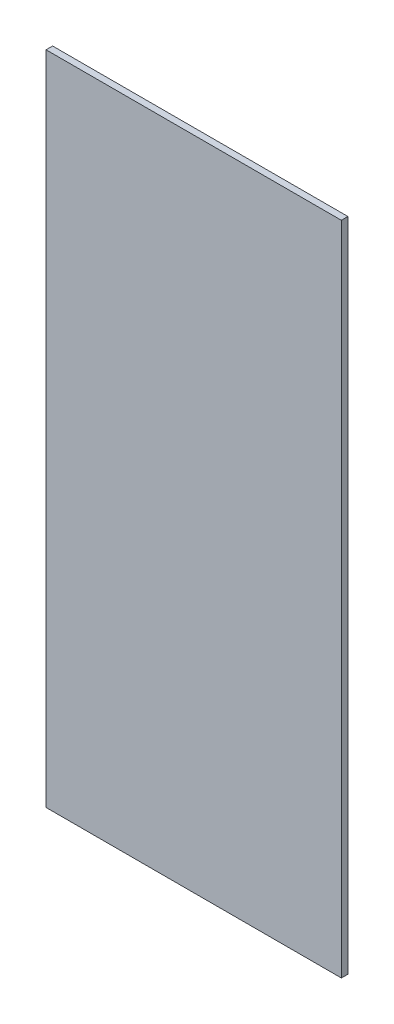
from build123d import *

# Parameters (mm, degrees)
SKIZZE1_W               = 900
SKIZZE1_H               = 2000
LINEAR_AUSTRAGEN1_DEPTH = 20


with BuildPart() as part:
    # Skizze1 → Linear austragen1 (new body)
    with BuildSketch(Plane.XY):
        with Locations((450, 1000)):
            Rectangle(SKIZZE1_W, SKIZZE1_H)
    extrude(amount=-LINEAR_AUSTRAGEN1_DEPTH)


solid = part.part
